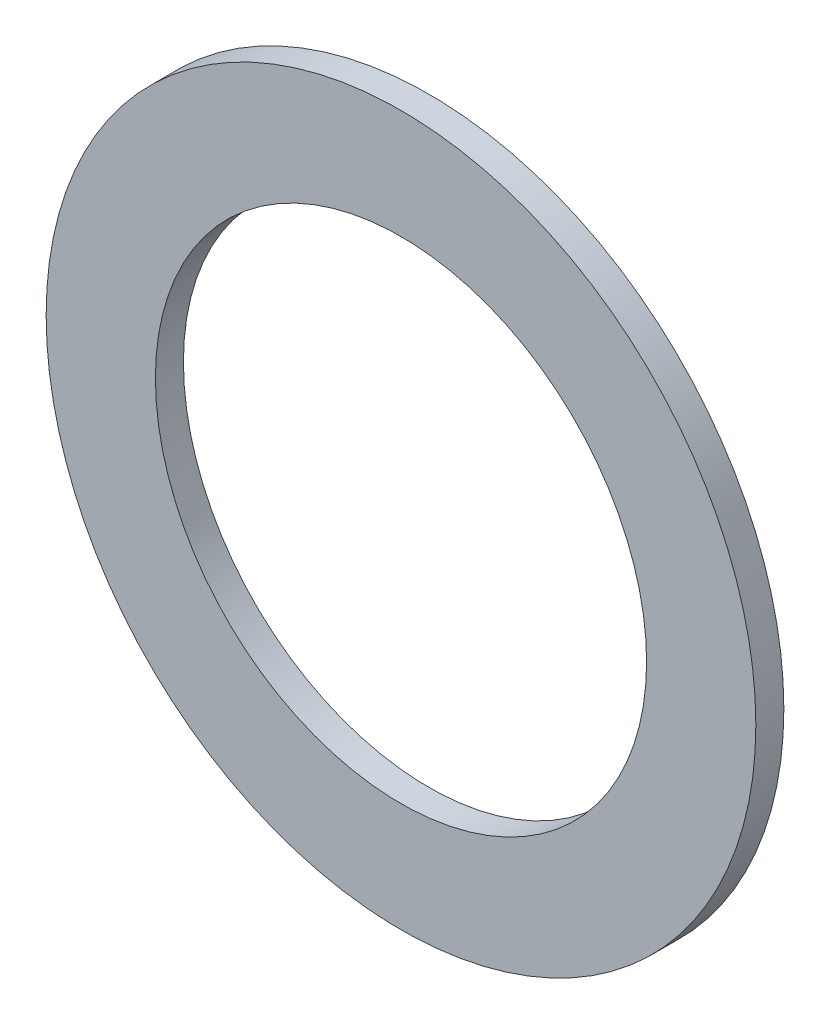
from build123d import *

# Parameters (mm, degrees)
ESQUISSE1_R          = 19
ESQUISSE1_R_2        = 13.15
BASE_EXTRUSION_DEPTH = 1.5


with BuildPart() as part:
    # Esquisse1 → Base-Extrusion (new body)
    with BuildSketch(Plane.XY):
        Circle(ESQUISSE1_R)
        Circle(ESQUISSE1_R_2, mode=Mode.SUBTRACT)
    extrude(amount=BASE_EXTRUSION_DEPTH)


solid = part.part
